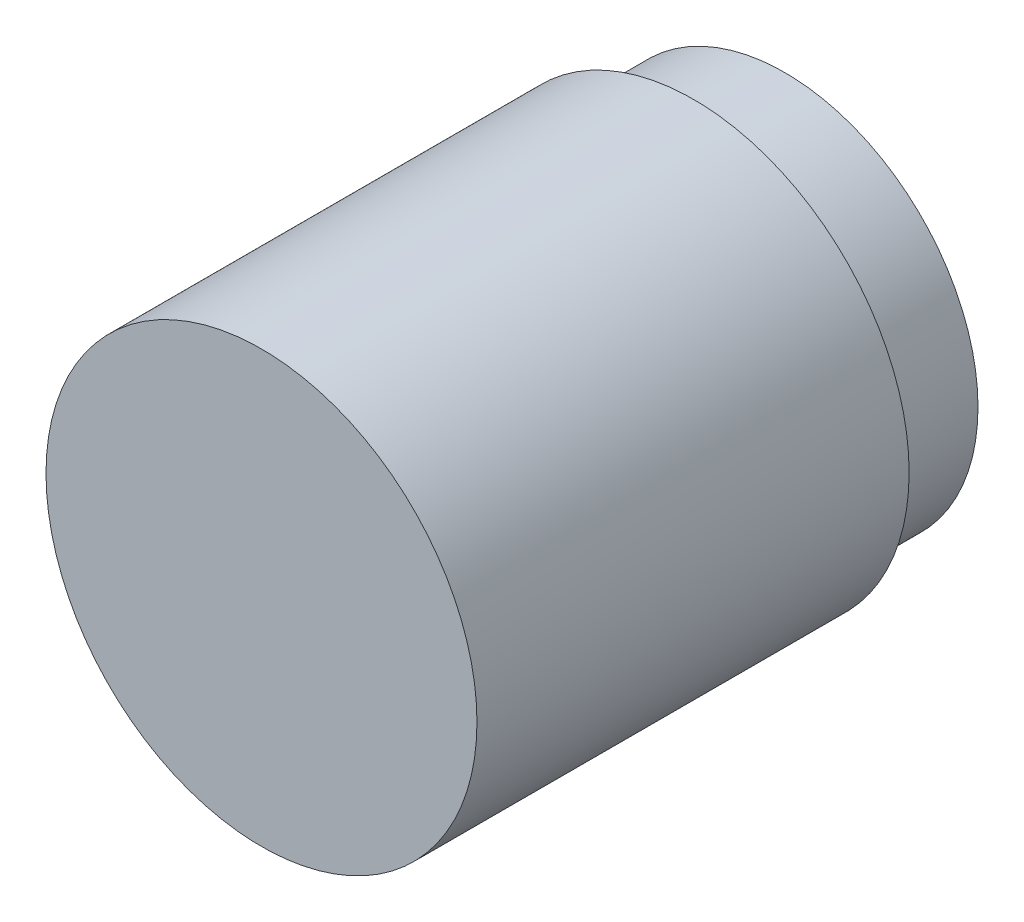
ISO-10303-21;
HEADER;
FILE_DESCRIPTION(('STEP AP214'),'2;1');
FILE_NAME('part.step','',(''),(''),'','','');
FILE_SCHEMA(('AUTOMOTIVE_DESIGN { 1 0 10303 214 1 1 1 1 }'));
ENDSEC;
DATA;
#1=APPLICATION_CONTEXT('core data for automotive mechanical design processes');
#2=APPLICATION_PROTOCOL_DEFINITION('international standard','automotive_design',2000,#1);
#3=PRODUCT_CONTEXT('',#1,'mechanical');
#4=PRODUCT('Part','Part','',(#3));
#5=PRODUCT_RELATED_PRODUCT_CATEGORY('part','',(#4));
#6=PRODUCT_DEFINITION_FORMATION('','',#4);
#7=PRODUCT_DEFINITION_CONTEXT('part definition',#1,'design');
#8=PRODUCT_DEFINITION('design','',#6,#7);
#9=PRODUCT_DEFINITION_SHAPE('','',#8);
#10=(LENGTH_UNIT() NAMED_UNIT(*) SI_UNIT(.MILLI.,.METRE.));
#11=(NAMED_UNIT(*) PLANE_ANGLE_UNIT() SI_UNIT($,.RADIAN.));
#12=(NAMED_UNIT(*) SI_UNIT($,.STERADIAN.) SOLID_ANGLE_UNIT());
#13=UNCERTAINTY_MEASURE_WITH_UNIT(LENGTH_MEASURE(1.E-05),#10,'distance_accuracy_value','');
#14=(GEOMETRIC_REPRESENTATION_CONTEXT(3) GLOBAL_UNCERTAINTY_ASSIGNED_CONTEXT((#13)) GLOBAL_UNIT_ASSIGNED_CONTEXT((#10,
#11,#12)) REPRESENTATION_CONTEXT('',''));
#15=CARTESIAN_POINT('',(0.,0.,0.));
#16=DIRECTION('',(0.,0.,1.));
#17=DIRECTION('',(1.,0.,0.));
#18=AXIS2_PLACEMENT_3D('',#15,#16,#17);
#19=CARTESIAN_POINT('',(0.,0.,36.068));
#20=DIRECTION('',(0.,0.,-1.));
#21=DIRECTION('',(-1.,0.,0.));
#22=AXIS2_PLACEMENT_3D('',#19,#20,#21);
#23=CYLINDRICAL_SURFACE('',#22,14.85);
#24=CARTESIAN_POINT('',(0.,0.,36.068));
#25=DIRECTION('',(0.,0.,1.));
#26=DIRECTION('',(1.,0.,0.));
#27=AXIS2_PLACEMENT_3D('',#24,#25,#26);
#28=CIRCLE('',#27,14.85);
#29=CARTESIAN_POINT('',(14.85,0.,36.068));
#30=VERTEX_POINT('',#29);
#31=EDGE_CURVE('E10',#30,#30,#28,.T.);
#32=ORIENTED_EDGE('',*,*,#31,.F.);
#33=EDGE_LOOP('',(#32));
#34=FACE_BOUND('',#33,.T.);
#35=CARTESIAN_POINT('',(0.,0.,6.2865));
#36=DIRECTION('',(0.,0.,-1.));
#37=DIRECTION('',(-1.,0.,0.));
#38=AXIS2_PLACEMENT_3D('',#35,#36,#37);
#39=CIRCLE('',#38,14.85);
#40=CARTESIAN_POINT('',(-14.85,0.,6.2865));
#41=VERTEX_POINT('',#40);
#42=EDGE_CURVE('E34',#41,#41,#39,.T.);
#43=ORIENTED_EDGE('',*,*,#42,.F.);
#44=EDGE_LOOP('',(#43));
#45=FACE_BOUND('',#44,.T.);
#46=ADVANCED_FACE('F28',(#34,#45),#23,.T.);
#47=CARTESIAN_POINT('',(0.,0.,36.068));
#48=DIRECTION('',(0.,0.,1.));
#49=DIRECTION('',(1.,0.,0.));
#50=AXIS2_PLACEMENT_3D('',#47,#48,#49);
#51=PLANE('',#50);
#52=ORIENTED_EDGE('',*,*,#31,.T.);
#53=EDGE_LOOP('',(#52));
#54=FACE_BOUND('',#53,.T.);
#55=ADVANCED_FACE('F60',(#54),#51,.T.);
#56=CARTESIAN_POINT('',(14.85,0.,6.2865));
#57=DIRECTION('',(0.,0.,-1.));
#58=DIRECTION('',(-1.,0.,0.));
#59=AXIS2_PLACEMENT_3D('',#56,#57,#58);
#60=PLANE('',#59);
#61=ORIENTED_EDGE('',*,*,#42,.T.);
#62=EDGE_LOOP('',(#61));
#63=FACE_BOUND('',#62,.T.);
#64=CARTESIAN_POINT('',(0.,0.,6.2865));
#65=DIRECTION('',(0.,0.,-1.));
#66=DIRECTION('',(-1.,0.,0.));
#67=AXIS2_PLACEMENT_3D('',#64,#65,#66);
#68=CIRCLE('',#67,13.31);
#69=CARTESIAN_POINT('',(-13.31,0.,6.2865));
#70=VERTEX_POINT('',#69);
#71=EDGE_CURVE('E38',#70,#70,#68,.T.);
#72=ORIENTED_EDGE('',*,*,#71,.F.);
#73=EDGE_LOOP('',(#72));
#74=FACE_BOUND('',#73,.T.);
#75=ADVANCED_FACE('F52',(#63,#74),#60,.T.);
#76=CARTESIAN_POINT('',(0.,0.,0.));
#77=DIRECTION('',(0.,0.,-1.));
#78=DIRECTION('',(-1.,0.,0.));
#79=AXIS2_PLACEMENT_3D('',#76,#77,#78);
#80=CYLINDRICAL_SURFACE('',#79,13.31);
#81=ORIENTED_EDGE('',*,*,#71,.T.);
#82=EDGE_LOOP('',(#81));
#83=FACE_BOUND('',#82,.T.);
#84=CARTESIAN_POINT('',(0.,0.,0.));
#85=DIRECTION('',(0.,0.,-1.));
#86=DIRECTION('',(-1.,0.,0.));
#87=AXIS2_PLACEMENT_3D('',#84,#85,#86);
#88=CIRCLE('',#87,13.31);
#89=CARTESIAN_POINT('',(-13.31,0.,0.));
#90=VERTEX_POINT('',#89);
#91=EDGE_CURVE('E42',#90,#90,#88,.T.);
#92=ORIENTED_EDGE('',*,*,#91,.F.);
#93=EDGE_LOOP('',(#92));
#94=FACE_BOUND('',#93,.T.);
#95=ADVANCED_FACE('F50',(#83,#94),#80,.T.);
#96=CARTESIAN_POINT('',(0.,0.,0.));
#97=DIRECTION('',(0.,0.,1.));
#98=DIRECTION('',(1.,0.,0.));
#99=AXIS2_PLACEMENT_3D('',#96,#97,#98);
#100=PLANE('',#99);
#101=ORIENTED_EDGE('',*,*,#91,.T.);
#102=EDGE_LOOP('',(#101));
#103=FACE_BOUND('',#102,.T.);
#104=ADVANCED_FACE('F48',(#103),#100,.F.);
#105=CLOSED_SHELL('',(#46,#55,#75,#95,#104));
#106=MANIFOLD_SOLID_BREP('B2',#105);
#107=ADVANCED_BREP_SHAPE_REPRESENTATION('',(#18,#106),#14);
#108=SHAPE_DEFINITION_REPRESENTATION(#9,#107);
ENDSEC;
END-ISO-10303-21;
